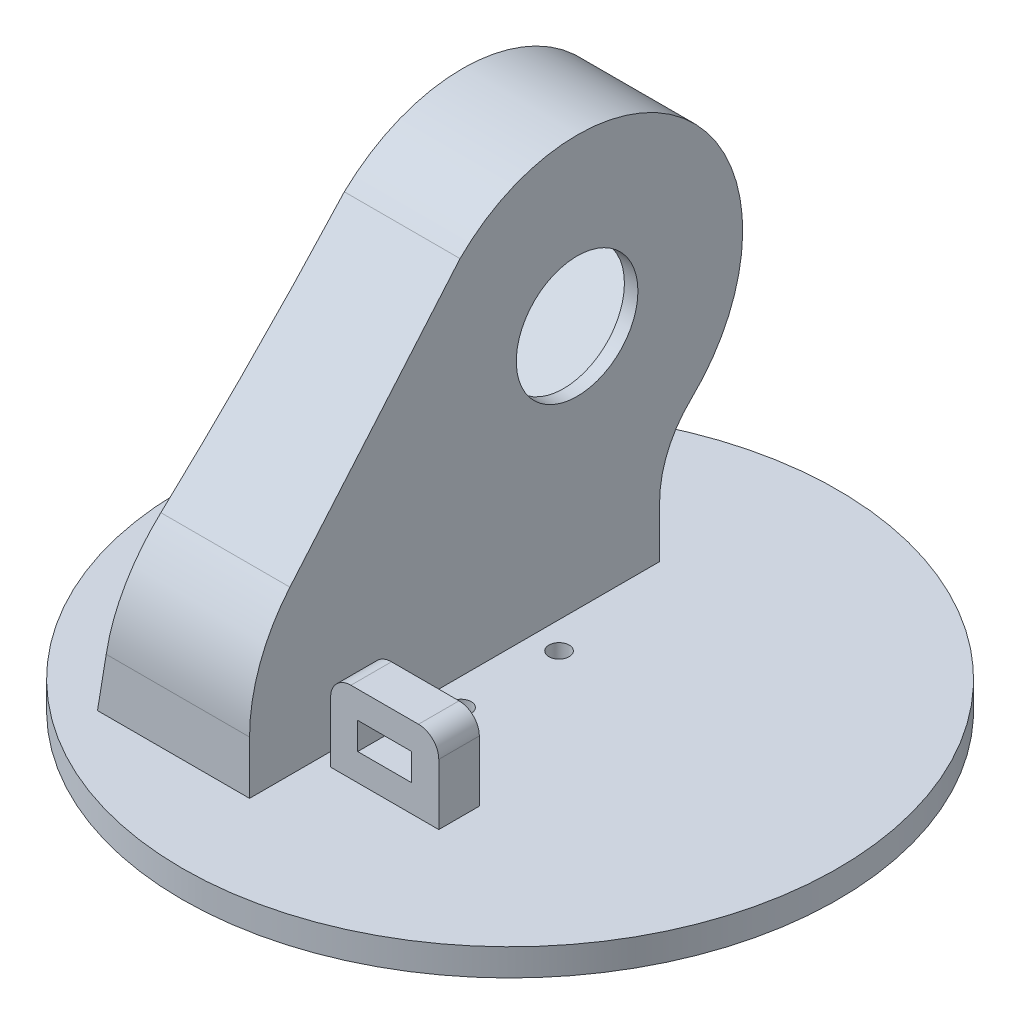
from build123d import *

# Parameters (mm, degrees)
SKETCH2_R                       = 48.5
BOSS_EXTRUDE1_DEPTH             = 4
SKETCH4_R                       = 1.5
CUT_EXTRUDE2_DEPTH              = 69.705894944
SKETCH5_R                       = 3.75
CUT_EXTRUDE3_DEPTH              = 1.5
BOSS_EXTRUDE2_DEPTH             = 14
CUT_EXTRUDE5_REACH              = 97.597
SKETCH9_R                       = 1.3
CUT_EXTRUDE6_DEPTH              = 7.5
CUT_EXTRUDE9_REACH              = 96.471
SKETCH11_R                      = 9
BOSS_EXTRUDE7_DEPTH             = 9
BOSS_EXTRUDE7_DIRECTION_2_REACH = 104.912
BOSS_EXTRUDE10_DEPTH            = 9
SKETCH27_W                      = 16
SKETCH27_H                      = 6
BOSS_EXTRUDE11_DEPTH            = 12
FILLET6_R                       = 3
CUT_EXTRUDE16_REACH             = 111.016
SKETCH28_W                      = 8
SKETCH28_H                      = 4
CUT_EXTRUDE17_DEPTH             = 95.342420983
CUT_EXTRUDE17_DEPTH_BACK        = 95.342420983


with BuildPart() as part:
    # Sketch2 → Boss-Extrude1 (new body)
    with BuildSketch(Plane(origin=(0, 0, 0), x_dir=(1, 0, 0), z_dir=(0, 1, 0))):
        with Locations(Location((0, 0, 0), (0, 0, 270))):
            Circle(SKETCH2_R)
    extrude(amount=BOSS_EXTRUDE1_DEPTH)

    # Sketch4 → Cut-Extrude2 (cut, through all)
    with BuildSketch(Plane.XZ):
        with Locations(Location((0, 7.25, 0), (0, 0, 270))):
            Circle(SKETCH4_R)
        with Locations(Location((0, -7.25, 0), (0, 0, 270))):
            Circle(SKETCH4_R)
    extrude(amount=-CUT_EXTRUDE2_DEPTH, mode=Mode.SUBTRACT)

    # Sketch5 → Cut-Extrude3 (cut)
    with BuildSketch(Plane.XZ):
        with Locations(Location((0, 0, 0), (0, 0, 270))):
            Circle(SKETCH5_R)
    extrude(amount=-CUT_EXTRUDE3_DEPTH, mode=Mode.SUBTRACT)

    # Sketch7 → Boss-Extrude2 (add)
    with BuildSketch(Plane(origin=(-4, 0, 0), x_dir=(0, 0, -1), z_dir=(1, 0, 0))):
        with BuildLine():
            Line((23.129947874, 4), (23.129947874, 11.644549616))
            ThreePointArc((23.129947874, 11.644549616), (24.589048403, 18.743749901), (28.729797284, 24.692011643))
            ThreePointArc((28.729797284, 24.692011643), (29.313383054, 55.284736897), (-1.284289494, 55.479275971))
            Line((-1.284289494, 55.479275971), (-27.227315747, 29.536249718))
            ThreePointArc((-27.227315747, 29.536249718), (-32.64663453, 21.425665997), (-34.549646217, 11.858580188))
            Line((-34.549646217, 11.858580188), (-34.549646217, 4))
            Line((-34.549646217, 4), (23.129947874, 4))
        make_face()
    extrude(amount=-BOSS_EXTRUDE2_DEPTH)

    # Sketch8 → Cut-Extrude5 (cut, up to next)
    with BuildSketch(Plane(origin=(-6, 0, 0), x_dir=(0, 0, -1), z_dir=(1, 0, 0)), mode=Mode.PRIVATE) as cut_extrude5_sk1:
        Polygon((-15.249648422, 25.957567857), (13.741729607, 54.948945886), (28.590972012, 40.099703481), (-0.400406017, 11.108325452), align=None)
    cut_extrude5_tool1 = extrude(cut_extrude5_sk1.sketch, amount=-CUT_EXTRUDE5_REACH, mode=Mode.PRIVATE) & part.part
    add(cut_extrude5_tool1.solids().sort_by_distance((-6, 33.028636, -6.670662))[0], mode=Mode.SUBTRACT)

    # Sketch9 → Cut-Extrude6 (cut)
    with BuildSketch(Plane.ZY.offset(18)):
        with Locations((-20.105690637, 53.534732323)):
            Circle(SKETCH9_R)
        with Locations((-27.176758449, 46.463664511)):
            Circle(SKETCH9_R)
        with Locations((6.764367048, 12.522539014)):
            Circle(SKETCH9_R)
        with Locations((13.83543486, 19.593606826)):
            Circle(SKETCH9_R)
    extrude(amount=-CUT_EXTRUDE6_DEPTH, mode=Mode.SUBTRACT)

    # Sketch11 → Cut-Extrude9 (cut, up to next)
    with BuildSketch(Plane(origin=(-4, 0, 0), x_dir=(0, 0, -1), z_dir=(1, 0, 0)), mode=Mode.PRIVATE) as cut_extrude9_sk1:
        with Locations((13.918506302, 40.276480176)):
            Circle(SKETCH11_R)
    cut_extrude9_tool1 = extrude(cut_extrude9_sk1.sketch, amount=-CUT_EXTRUDE9_REACH, mode=Mode.PRIVATE) & part.part
    add(cut_extrude9_tool1.solids().sort_by_distance((-4, 40.27648, -13.918506))[0], mode=Mode.SUBTRACT)

    # Sketch17 → Boss-Extrude7 (add)
    with BuildSketch(Plane.ZY.offset(18)):
        with BuildLine():
            ThreePointArc((34.549646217, 11.858580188), (33.008342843, 20.500891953), (28.574482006, 28.077569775))
            ThreePointArc((28.574482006, 28.077569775), (27.915386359, 28.820289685), (27.227315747, 29.536249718))
            Line((27.227315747, 29.536249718), (1.284289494, 55.479275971))
            Line((1.284289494, 55.479275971), (26.295003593, 26.127182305))
            ThreePointArc((26.295003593, 26.127182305), (30.194232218, 19.461281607), (31.549646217, 11.858580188))
            Line((31.549646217, 11.858580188), (31.549646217, 4))
            Line((31.549646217, 4), (34.549646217, 4))
            Line((34.549646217, 4), (34.549646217, 11.858580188))
        make_face()
        with BuildLine():
            Line((28.574482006, 28.077569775), (3.405609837, 57.600596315))
            ThreePointArc((3.405609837, 57.600596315), (-31.461505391, 57.378912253), (-30.796489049, 22.517434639))
            ThreePointArc((-30.796489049, 22.517434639), (-27.345864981, 17.560549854), (-26.129947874, 11.644549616))
            Line((-26.129947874, 11.644549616), (-26.129947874, 4))
            Line((-26.129947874, 4), (-23.129947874, 4))
            Line((-23.129947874, 4), (-23.129947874, 11.644549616))
            ThreePointArc((-23.129947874, 11.644549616), (-24.589048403, 18.743749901), (-28.729797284, 24.692011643))
            ThreePointArc((-28.729797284, 24.692011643), (-29.313383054, 55.284736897), (1.284289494, 55.479275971))
            Line((1.284289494, 55.479275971), (27.227315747, 29.536249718))
            ThreePointArc((27.227315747, 29.536249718), (27.915386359, 28.820289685), (28.574482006, 28.077569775))
        make_face()
    extrude(amount=BOSS_EXTRUDE7_DEPTH)

    # Boss-Extrude7 direction 2: up to this face of the body (flat: up to its plane)
    boss_extrude7_direction_2_end = Plane(part.part.faces().sort_by_distance((-4, 28.276431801, -1.649713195))[0])
    # Sketch17 → Boss-Extrude7 direction 2 (add, up to the picked face)
    with BuildSketch(Plane.ZY.offset(18), mode=Mode.PRIVATE) as boss_extrude7_direction_2_sk1:
        with BuildLine():
            ThreePointArc((34.549646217, 11.858580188), (33.008342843, 20.500891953), (28.574482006, 28.077569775))
            ThreePointArc((28.574482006, 28.077569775), (27.915386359, 28.820289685), (27.227315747, 29.536249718))
            Line((27.227315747, 29.536249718), (1.284289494, 55.479275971))
            Line((1.284289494, 55.479275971), (26.295003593, 26.127182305))
            ThreePointArc((26.295003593, 26.127182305), (30.194232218, 19.461281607), (31.549646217, 11.858580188))
            Line((31.549646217, 11.858580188), (31.549646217, 4))
            Line((31.549646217, 4), (34.549646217, 4))
            Line((34.549646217, 4), (34.549646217, 11.858580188))
        make_face()
    boss_extrude7_direction_2_tool1 = split(extrude(boss_extrude7_direction_2_sk1.sketch, amount=-BOSS_EXTRUDE7_DIRECTION_2_REACH, mode=Mode.PRIVATE), bisect_by=boss_extrude7_direction_2_end, keep=Keep.BOTH, mode=Mode.PRIVATE)
    # Sketch17 → Boss-Extrude7 direction 2 (add, up to the picked face)
    with BuildSketch(Plane.ZY.offset(18), mode=Mode.PRIVATE) as boss_extrude7_direction_2_sk2:
        with BuildLine():
            Line((28.574482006, 28.077569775), (3.405609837, 57.600596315))
            ThreePointArc((3.405609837, 57.600596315), (-31.461505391, 57.378912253), (-30.796489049, 22.517434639))
            ThreePointArc((-30.796489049, 22.517434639), (-27.345864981, 17.560549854), (-26.129947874, 11.644549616))
            Line((-26.129947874, 11.644549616), (-26.129947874, 4))
            Line((-26.129947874, 4), (-23.129947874, 4))
            Line((-23.129947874, 4), (-23.129947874, 11.644549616))
            ThreePointArc((-23.129947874, 11.644549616), (-24.589048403, 18.743749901), (-28.729797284, 24.692011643))
            ThreePointArc((-28.729797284, 24.692011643), (-29.313383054, 55.284736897), (1.284289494, 55.479275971))
            Line((1.284289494, 55.479275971), (27.227315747, 29.536249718))
            ThreePointArc((27.227315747, 29.536249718), (27.915386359, 28.820289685), (28.574482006, 28.077569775))
        make_face()
    boss_extrude7_direction_2_tool2 = split(extrude(boss_extrude7_direction_2_sk2.sketch, amount=-BOSS_EXTRUDE7_DIRECTION_2_REACH, mode=Mode.PRIVATE), bisect_by=boss_extrude7_direction_2_end, keep=Keep.BOTH, mode=Mode.PRIVATE)
    add(boss_extrude7_direction_2_tool1.solids().sort_by(Axis((-18, 4.612919, 33.049646), (1, 0, 0)))[0])
    add(boss_extrude7_direction_2_tool2.solids().sort_by(Axis((-18, 43.147366, 14.895406), (1, 0, 0)))[0])

    # Sketch25 → Boss-Extrude10 (add)
    with BuildSketch(Plane.ZY.offset(18)):
        with BuildLine():
            ThreePointArc((-28.729797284, 24.692011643), (-24.589048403, 18.743749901), (-23.129947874, 11.644549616))
            Line((-23.129947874, 11.644549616), (-23.129947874, 4))
            Line((-23.129947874, 4), (-15.129947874, 4))
            add(Edge.make_bspline(
                [(-28.729797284, 24.692011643), (-21.954867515, 18.253200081), (-19.09405247, 12.798017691), (-15.129947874, 4)],
                knots=[0, 0, 0, 0, 1, 1, 1, 1], degree=3))
        make_face()
        with BuildLine():
            add(Edge.make_bspline(
                [(11.751619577, 43.19501844), (26.551255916, 25.8264495), (25.549646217, 4)],
                knots=[0, 0, 0, 1, 1, 1], degree=2))
            Line((25.549646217, 4), (31.549646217, 4))
            Line((31.549646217, 4), (31.549646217, 11.858580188))
            ThreePointArc((31.549646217, 11.858580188), (30.194232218, 19.461281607), (26.295003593, 26.127182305))
            Line((26.295003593, 26.127182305), (11.751619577, 43.19501844))
        make_face()
    extrude(amount=BOSS_EXTRUDE10_DEPTH)

    # Sketch27 → Boss-Extrude11 (add)
    with BuildSketch(Plane(origin=(0, 4, 0), x_dir=(1, 0, 0), z_dir=(0, 1, 0))):
        with Locations((6, -21.549646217)):
            Rectangle(SKETCH27_W, SKETCH27_H)
    extrude(amount=BOSS_EXTRUDE11_DEPTH)

    # Fillet6
    fillet6_edges = [part.edges().sort_by_distance(p)[0] for p in [
        (-2, 16, 21.549646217),
        (14, 16, 21.549646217),
    ]]
    fillet(fillet6_edges, radius=FILLET6_R)

    # Sketch28 → Cut-Extrude16 (cut, up to next)
    with BuildSketch(Plane.XY.offset(24.549646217), mode=Mode.PRIVATE) as cut_extrude16_sk1:
        with Locations((6, 10)):
            Rectangle(SKETCH28_W, SKETCH28_H)
    cut_extrude16_tool1 = extrude(cut_extrude16_sk1.sketch, amount=-CUT_EXTRUDE16_REACH, mode=Mode.PRIVATE) & part.part
    add(cut_extrude16_tool1.solids().sort_by_distance((6, 10, 24.549646))[0], mode=Mode.SUBTRACT)

    # Sketch29 → Cut-Extrude17 (cut, two sides: drawn at the far end of the back side and taken through both)
    with BuildSketch(Plane.XY.offset(-CUT_EXTRUDE17_DEPTH_BACK)):
        with BuildLine():
            Line((-21, 64.776480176), (-27, 64.776480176))
            Line((-27, 64.776480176), (-27, 4))
            Line((-27, 4), (-26.5, 4))
            add(Edge.make_bspline(
                [(-21, 64.776480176), (-21.220459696, 34.140901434), (-26.5, 4)],
                knots=[0, 0, 0, 1, 1, 1], degree=2))
        make_face()
    extrude(amount=CUT_EXTRUDE17_DEPTH + CUT_EXTRUDE17_DEPTH_BACK, mode=Mode.SUBTRACT)


solid = part.part
